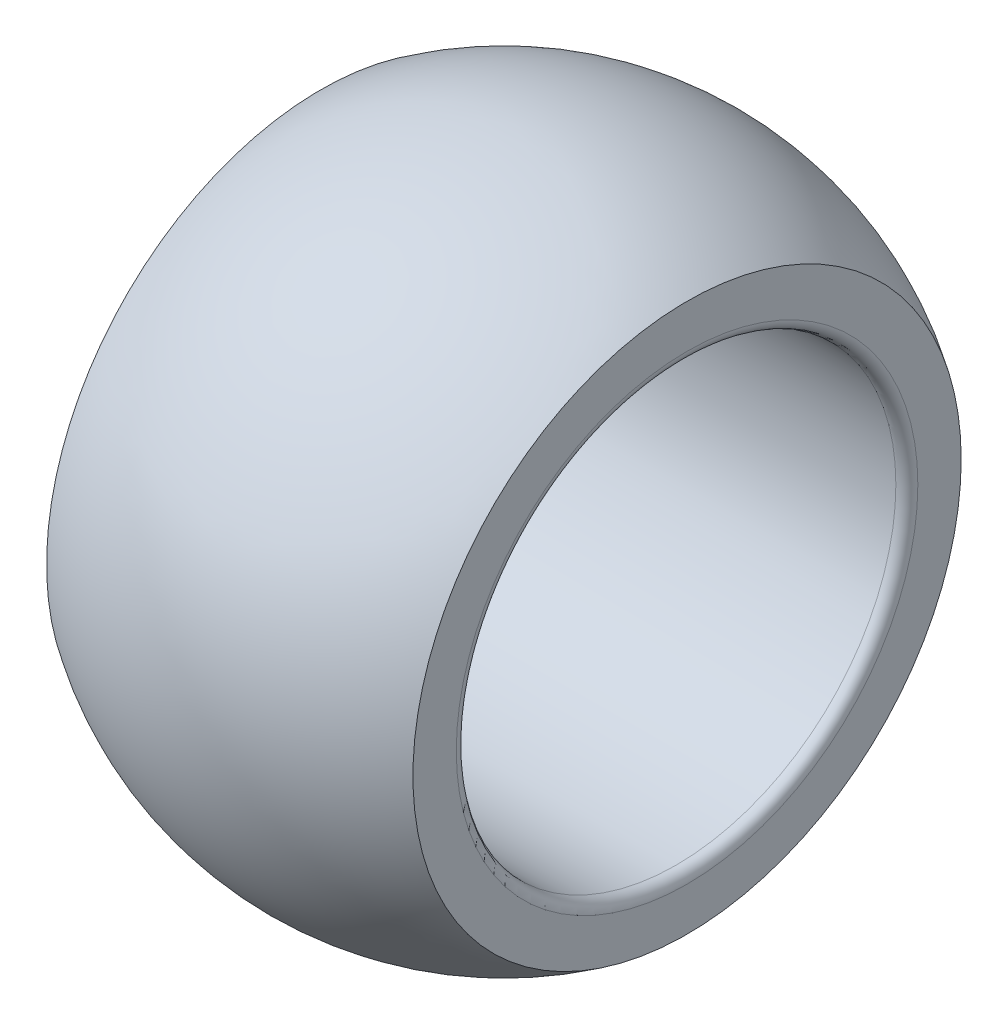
ISO-10303-21;
HEADER;
FILE_DESCRIPTION(('STEP AP214'),'2;1');
FILE_NAME('part.step','',(''),(''),'','','');
FILE_SCHEMA(('AUTOMOTIVE_DESIGN { 1 0 10303 214 1 1 1 1 }'));
ENDSEC;
DATA;
#1=APPLICATION_CONTEXT('core data for automotive mechanical design processes');
#2=APPLICATION_PROTOCOL_DEFINITION('international standard','automotive_design',2000,#1);
#3=PRODUCT_CONTEXT('',#1,'mechanical');
#4=PRODUCT('Part','Part','',(#3));
#5=PRODUCT_RELATED_PRODUCT_CATEGORY('part','',(#4));
#6=PRODUCT_DEFINITION_FORMATION('','',#4);
#7=PRODUCT_DEFINITION_CONTEXT('part definition',#1,'design');
#8=PRODUCT_DEFINITION('design','',#6,#7);
#9=PRODUCT_DEFINITION_SHAPE('','',#8);
#10=(LENGTH_UNIT() NAMED_UNIT(*) SI_UNIT(.MILLI.,.METRE.));
#11=(NAMED_UNIT(*) PLANE_ANGLE_UNIT() SI_UNIT($,.RADIAN.));
#12=(NAMED_UNIT(*) SI_UNIT($,.STERADIAN.) SOLID_ANGLE_UNIT());
#13=UNCERTAINTY_MEASURE_WITH_UNIT(LENGTH_MEASURE(1.E-05),#10,'distance_accuracy_value','');
#14=(GEOMETRIC_REPRESENTATION_CONTEXT(3) GLOBAL_UNCERTAINTY_ASSIGNED_CONTEXT((#13)) GLOBAL_UNIT_ASSIGNED_CONTEXT((#10,
#11,#12)) REPRESENTATION_CONTEXT('',''));
#15=CARTESIAN_POINT('',(0.,0.,0.));
#16=DIRECTION('',(0.,0.,1.));
#17=DIRECTION('',(1.,0.,0.));
#18=AXIS2_PLACEMENT_3D('',#15,#16,#17);
#19=CARTESIAN_POINT('',(5.00000000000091,1.53696499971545E-12,0.));
#20=DIRECTION('',(1.,0.,0.));
#21=DIRECTION('',(0.,1.,0.));
#22=AXIS2_PLACEMENT_3D('',#19,#20,#21);
#23=SPHERICAL_SURFACE('',#22,8.99999999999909);
#24=CARTESIAN_POINT('',(10.,1.53696499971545E-12,0.));
#25=DIRECTION('',(1.,0.,0.));
#26=DIRECTION('',(0.,0.,-1.));
#27=AXIS2_PLACEMENT_3D('',#24,#25,#26);
#28=CIRCLE('',#27,7.4833147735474);
#29=CARTESIAN_POINT('',(10.,1.53696499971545E-12,-7.4833147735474));
#30=VERTEX_POINT('',#29);
#31=EDGE_CURVE('E216',#30,#30,#28,.T.);
#32=ORIENTED_EDGE('',*,*,#31,.F.);
#33=EDGE_LOOP('',(#32));
#34=FACE_BOUND('',#33,.T.);
#35=CARTESIAN_POINT('',(0.,1.53696499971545E-12,0.));
#36=DIRECTION('',(1.,0.,0.));
#37=DIRECTION('',(0.,0.,-1.));
#38=AXIS2_PLACEMENT_3D('',#35,#36,#37);
#39=CIRCLE('',#38,7.48331477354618);
#40=CARTESIAN_POINT('',(0.,1.53696499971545E-12,-7.48331477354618));
#41=VERTEX_POINT('',#40);
#42=EDGE_CURVE('E61',#41,#41,#39,.F.);
#43=ORIENTED_EDGE('',*,*,#42,.F.);
#44=EDGE_LOOP('',(#43));
#45=FACE_BOUND('',#44,.T.);
#46=ADVANCED_FACE('F16',(#34,#45),#23,.T.);
#47=CARTESIAN_POINT('',(10.,6.3,0.));
#48=DIRECTION('',(1.,0.,0.));
#49=DIRECTION('',(0.,0.,-1.));
#50=AXIS2_PLACEMENT_3D('',#47,#48,#49);
#51=PLANE('',#50);
#52=CARTESIAN_POINT('',(10.,0.,0.));
#53=DIRECTION('',(1.,0.,0.));
#54=DIRECTION('',(0.,-1.,0.));
#55=AXIS2_PLACEMENT_3D('',#52,#53,#54);
#56=CIRCLE('',#55,6.29999999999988);
#57=CARTESIAN_POINT('',(10.,-6.2999999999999,0.));
#58=VERTEX_POINT('',#57);
#59=CARTESIAN_POINT('',(10.,6.29999999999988,0.));
#60=VERTEX_POINT('',#59);
#61=EDGE_CURVE('E51',#58,#60,#56,.T.);
#62=ORIENTED_EDGE('',*,*,#61,.F.);
#63=CARTESIAN_POINT('',(10.,0.,0.));
#64=DIRECTION('',(1.,0.,0.));
#65=DIRECTION('',(0.,0.,1.));
#66=AXIS2_PLACEMENT_3D('',#63,#64,#65);
#67=CIRCLE('',#66,6.29999999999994);
#68=CARTESIAN_POINT('',(10.,0.,6.29999999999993));
#69=VERTEX_POINT('',#68);
#70=EDGE_CURVE('E57',#69,#58,#67,.T.);
#71=ORIENTED_EDGE('',*,*,#70,.F.);
#72=CARTESIAN_POINT('',(10.,0.,0.));
#73=DIRECTION('',(1.,0.,0.));
#74=DIRECTION('',(0.,1.,0.));
#75=AXIS2_PLACEMENT_3D('',#72,#73,#74);
#76=CIRCLE('',#75,6.29999999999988);
#77=EDGE_CURVE('E54',#60,#69,#76,.T.);
#78=ORIENTED_EDGE('',*,*,#77,.F.);
#79=EDGE_LOOP('',(#62,#71,#78));
#80=FACE_BOUND('',#79,.T.);
#81=ORIENTED_EDGE('',*,*,#31,.T.);
#82=EDGE_LOOP('',(#81));
#83=FACE_BOUND('',#82,.T.);
#84=ADVANCED_FACE('F64',(#80,#83),#51,.T.);
#85=CARTESIAN_POINT('',(0.,7.4833147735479,0.));
#86=DIRECTION('',(-1.,0.,0.));
#87=DIRECTION('',(0.,0.,1.));
#88=AXIS2_PLACEMENT_3D('',#85,#86,#87);
#89=PLANE('',#88);
#90=ORIENTED_EDGE('',*,*,#42,.T.);
#91=EDGE_LOOP('',(#90));
#92=FACE_BOUND('',#91,.T.);
#93=CARTESIAN_POINT('',(0.,0.,0.));
#94=DIRECTION('',(-1.,0.,0.));
#95=DIRECTION('',(0.,1.,0.));
#96=AXIS2_PLACEMENT_3D('',#93,#94,#95);
#97=CIRCLE('',#96,6.29999999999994);
#98=CARTESIAN_POINT('',(0.,6.29999999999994,0.));
#99=VERTEX_POINT('',#98);
#100=CARTESIAN_POINT('',(0.,0.,-6.29999999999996));
#101=VERTEX_POINT('',#100);
#102=EDGE_CURVE('E135',#99,#101,#97,.T.);
#103=ORIENTED_EDGE('',*,*,#102,.F.);
#104=CARTESIAN_POINT('',(0.,0.,0.));
#105=DIRECTION('',(-1.,0.,0.));
#106=DIRECTION('',(0.,-1.,0.));
#107=AXIS2_PLACEMENT_3D('',#104,#105,#106);
#108=CIRCLE('',#107,6.29999999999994);
#109=CARTESIAN_POINT('',(0.,-6.29999999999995,0.));
#110=VERTEX_POINT('',#109);
#111=EDGE_CURVE('E145',#110,#99,#108,.T.);
#112=ORIENTED_EDGE('',*,*,#111,.F.);
#113=CARTESIAN_POINT('',(0.,0.,0.));
#114=DIRECTION('',(-1.,0.,0.));
#115=DIRECTION('',(0.,0.,-1.));
#116=AXIS2_PLACEMENT_3D('',#113,#114,#115);
#117=CIRCLE('',#116,6.29999999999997);
#118=EDGE_CURVE('E37',#101,#110,#117,.T.);
#119=ORIENTED_EDGE('',*,*,#118,.F.);
#120=EDGE_LOOP('',(#103,#112,#119));
#121=FACE_BOUND('',#120,.T.);
#122=ADVANCED_FACE('F80',(#92,#121),#89,.T.);
#123=CARTESIAN_POINT('',(9.70000000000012,0.,0.));
#124=DIRECTION('',(1.,0.,0.));
#125=DIRECTION('',(0.,-1.,0.));
#126=AXIS2_PLACEMENT_3D('',#123,#124,#125);
#127=TOROIDAL_SURFACE('',#126,6.29999999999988,0.299999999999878);
#128=CARTESIAN_POINT('',(9.7,0.,0.));
#129=DIRECTION('',(1.,0.,0.));
#130=DIRECTION('',(0.,0.,-1.));
#131=AXIS2_PLACEMENT_3D('',#128,#129,#130);
#132=CIRCLE('',#131,6.);
#133=CARTESIAN_POINT('',(9.7,0.,-6.));
#134=VERTEX_POINT('',#133);
#135=EDGE_CURVE('E28',#134,#134,#132,.F.);
#136=ORIENTED_EDGE('',*,*,#135,.T.);
#137=EDGE_LOOP('',(#136));
#138=FACE_BOUND('',#137,.T.);
#139=ORIENTED_EDGE('',*,*,#70,.T.);
#140=ORIENTED_EDGE('',*,*,#61,.T.);
#141=ORIENTED_EDGE('',*,*,#77,.T.);
#142=EDGE_LOOP('',(#139,#140,#141));
#143=FACE_BOUND('',#142,.T.);
#144=ADVANCED_FACE('F53',(#138,#143),#127,.T.);
#145=CARTESIAN_POINT('',(0.299999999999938,0.,0.));
#146=DIRECTION('',(1.,0.,0.));
#147=DIRECTION('',(0.,-1.,0.));
#148=AXIS2_PLACEMENT_3D('',#145,#146,#147);
#149=TOROIDAL_SURFACE('',#148,6.29999999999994,0.299999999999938);
#150=ORIENTED_EDGE('',*,*,#111,.T.);
#151=ORIENTED_EDGE('',*,*,#102,.T.);
#152=ORIENTED_EDGE('',*,*,#118,.T.);
#153=EDGE_LOOP('',(#150,#151,#152));
#154=FACE_BOUND('',#153,.T.);
#155=CARTESIAN_POINT('',(0.300000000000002,0.,0.));
#156=DIRECTION('',(1.,0.,0.));
#157=DIRECTION('',(0.,0.,-1.));
#158=AXIS2_PLACEMENT_3D('',#155,#156,#157);
#159=CIRCLE('',#158,6.);
#160=CARTESIAN_POINT('',(0.300000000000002,0.,-6.));
#161=VERTEX_POINT('',#160);
#162=EDGE_CURVE('E10',#161,#161,#159,.T.);
#163=ORIENTED_EDGE('',*,*,#162,.T.);
#164=EDGE_LOOP('',(#163));
#165=FACE_BOUND('',#164,.T.);
#166=ADVANCED_FACE('F112',(#154,#165),#149,.T.);
#167=CARTESIAN_POINT('',(50.,0.,0.));
#168=DIRECTION('',(1.,0.,0.));
#169=DIRECTION('',(0.,0.,-1.));
#170=AXIS2_PLACEMENT_3D('',#167,#168,#169);
#171=CYLINDRICAL_SURFACE('',#170,6.);
#172=ORIENTED_EDGE('',*,*,#135,.F.);
#173=EDGE_LOOP('',(#172));
#174=FACE_BOUND('',#173,.T.);
#175=ORIENTED_EDGE('',*,*,#162,.F.);
#176=EDGE_LOOP('',(#175));
#177=FACE_BOUND('',#176,.T.);
#178=ADVANCED_FACE('F174',(#174,#177),#171,.F.);
#179=CLOSED_SHELL('',(#46,#84,#122,#144,#166,#178));
#180=MANIFOLD_SOLID_BREP('B1',#179);
#181=ADVANCED_BREP_SHAPE_REPRESENTATION('',(#18,#180),#14);
#182=SHAPE_DEFINITION_REPRESENTATION(#9,#181);
ENDSEC;
END-ISO-10303-21;
